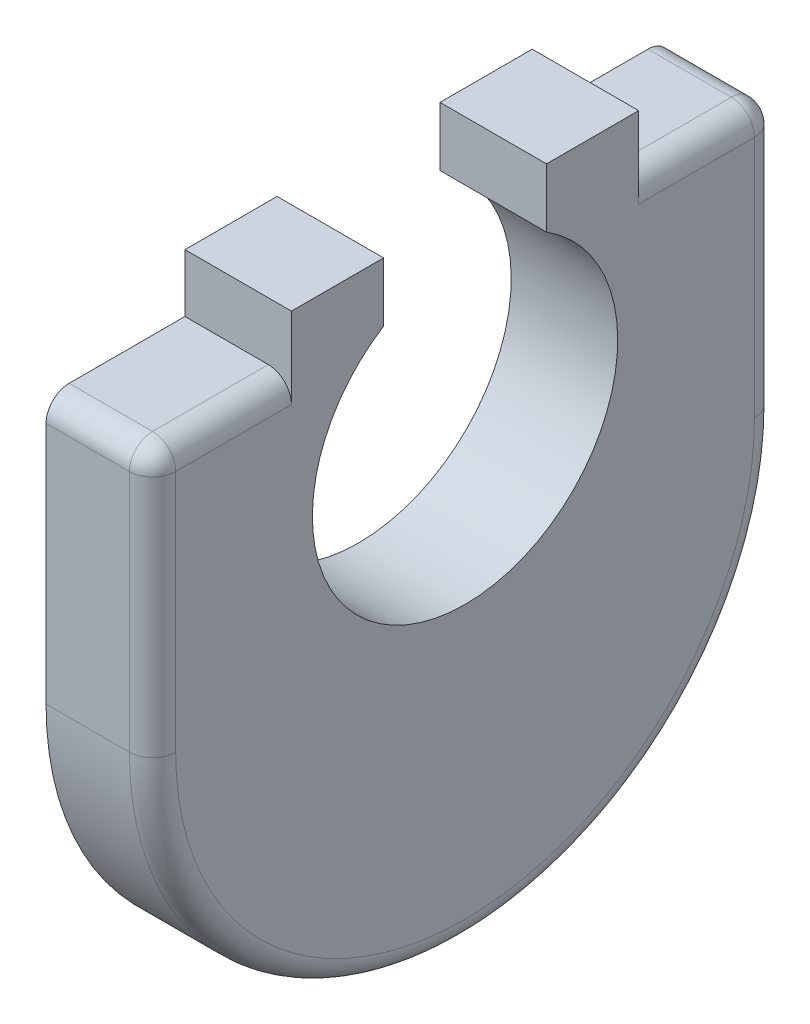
ISO-10303-21;
HEADER;
FILE_DESCRIPTION(('STEP AP214'),'2;1');
FILE_NAME('part.step','',(''),(''),'','','');
FILE_SCHEMA(('AUTOMOTIVE_DESIGN { 1 0 10303 214 1 1 1 1 }'));
ENDSEC;
DATA;
#1=APPLICATION_CONTEXT('core data for automotive mechanical design processes');
#2=APPLICATION_PROTOCOL_DEFINITION('international standard','automotive_design',2000,#1);
#3=PRODUCT_CONTEXT('',#1,'mechanical');
#4=PRODUCT('Part','Part','',(#3));
#5=PRODUCT_RELATED_PRODUCT_CATEGORY('part','',(#4));
#6=PRODUCT_DEFINITION_FORMATION('','',#4);
#7=PRODUCT_DEFINITION_CONTEXT('part definition',#1,'design');
#8=PRODUCT_DEFINITION('design','',#6,#7);
#9=PRODUCT_DEFINITION_SHAPE('','',#8);
#10=(LENGTH_UNIT() NAMED_UNIT(*) SI_UNIT(.MILLI.,.METRE.));
#11=(NAMED_UNIT(*) PLANE_ANGLE_UNIT() SI_UNIT($,.RADIAN.));
#12=(NAMED_UNIT(*) SI_UNIT($,.STERADIAN.) SOLID_ANGLE_UNIT());
#13=UNCERTAINTY_MEASURE_WITH_UNIT(LENGTH_MEASURE(1.E-05),#10,'distance_accuracy_value','');
#14=(GEOMETRIC_REPRESENTATION_CONTEXT(3) GLOBAL_UNCERTAINTY_ASSIGNED_CONTEXT((#13)) GLOBAL_UNIT_ASSIGNED_CONTEXT((#10,
#11,#12)) REPRESENTATION_CONTEXT('',''));
#15=CARTESIAN_POINT('',(0.,0.,0.));
#16=DIRECTION('',(0.,0.,1.));
#17=DIRECTION('',(1.,0.,0.));
#18=AXIS2_PLACEMENT_3D('',#15,#16,#17);
#19=CARTESIAN_POINT('',(2.921,17.78,9.525));
#20=DIRECTION('',(0.,-1.,0.));
#21=DIRECTION('',(0.,0.,-1.));
#22=AXIS2_PLACEMENT_3D('',#19,#20,#21);
#23=PLANE('',#22);
#24=DIRECTION('',(1.,0.,0.));
#25=VECTOR('',#24,1.);
#26=CARTESIAN_POINT('',(-2.921,17.78,-4.46848893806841));
#27=LINE('',#26,#25);
#28=CARTESIAN_POINT('',(-2.921,17.78,-4.46848893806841));
#29=VERTEX_POINT('',#28);
#30=CARTESIAN_POINT('',(2.921,17.78,-4.46848893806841));
#31=VERTEX_POINT('',#30);
#32=EDGE_CURVE('E264',#29,#31,#27,.T.);
#33=ORIENTED_EDGE('',*,*,#32,.T.);
#34=DIRECTION('',(0.,0.,1.));
#35=VECTOR('',#34,1.);
#36=CARTESIAN_POINT('',(2.921,17.78,9.525));
#37=LINE('',#36,#35);
#38=CARTESIAN_POINT('',(2.921,17.78,-9.525));
#39=VERTEX_POINT('',#38);
#40=EDGE_CURVE('E273',#39,#31,#37,.T.);
#41=ORIENTED_EDGE('',*,*,#40,.F.);
#42=DIRECTION('',(-1.,0.,0.));
#43=VECTOR('',#42,1.);
#44=CARTESIAN_POINT('',(2.921,17.78,-9.525));
#45=LINE('',#44,#43);
#46=CARTESIAN_POINT('',(-2.921,17.78,-9.525));
#47=VERTEX_POINT('',#46);
#48=EDGE_CURVE('E308',#39,#47,#45,.T.);
#49=ORIENTED_EDGE('',*,*,#48,.T.);
#50=DIRECTION('',(0.,0.,1.));
#51=VECTOR('',#50,1.);
#52=CARTESIAN_POINT('',(-2.921,17.78,9.525));
#53=LINE('',#52,#51);
#54=EDGE_CURVE('E291',#47,#29,#53,.T.);
#55=ORIENTED_EDGE('',*,*,#54,.T.);
#56=EDGE_LOOP('',(#33,#41,#49,#55));
#57=FACE_BOUND('',#56,.T.);
#58=ADVANCED_FACE('F32',(#57),#23,.F.);
#59=CARTESIAN_POINT('',(2.921,0.,0.));
#60=DIRECTION('',(-1.,0.,0.));
#61=DIRECTION('',(0.,0.,1.));
#62=AXIS2_PLACEMENT_3D('',#59,#60,#61);
#63=CYLINDRICAL_SURFACE('',#62,17.145);
#64=DIRECTION('',(-1.,0.,0.));
#65=VECTOR('',#64,1.);
#66=CARTESIAN_POINT('',(2.921,0.,-17.145));
#67=LINE('',#66,#65);
#68=CARTESIAN_POINT('',(1.651,0.,-17.145));
#69=VERTEX_POINT('',#68);
#70=CARTESIAN_POINT('',(-2.921,0.,-17.145));
#71=VERTEX_POINT('',#70);
#72=EDGE_CURVE('E313',#69,#71,#67,.T.);
#73=ORIENTED_EDGE('',*,*,#72,.F.);
#74=CARTESIAN_POINT('',(1.651,0.,0.));
#75=DIRECTION('',(1.,0.,0.));
#76=DIRECTION('',(0.,0.,-1.));
#77=AXIS2_PLACEMENT_3D('',#74,#75,#76);
#78=CIRCLE('',#77,17.145);
#79=CARTESIAN_POINT('',(1.651,0.,17.145));
#80=VERTEX_POINT('',#79);
#81=EDGE_CURVE('E331',#69,#80,#78,.F.);
#82=ORIENTED_EDGE('',*,*,#81,.T.);
#83=DIRECTION('',(-1.,0.,0.));
#84=VECTOR('',#83,1.);
#85=CARTESIAN_POINT('',(2.921,0.,17.145));
#86=LINE('',#85,#84);
#87=CARTESIAN_POINT('',(-2.921,0.,17.145));
#88=VERTEX_POINT('',#87);
#89=EDGE_CURVE('E278',#80,#88,#86,.T.);
#90=ORIENTED_EDGE('',*,*,#89,.T.);
#91=CARTESIAN_POINT('',(-2.921,0.,0.));
#92=DIRECTION('',(1.,0.,0.));
#93=DIRECTION('',(0.,0.,-1.));
#94=AXIS2_PLACEMENT_3D('',#91,#92,#93);
#95=CIRCLE('',#94,17.145);
#96=EDGE_CURVE('E279',#88,#71,#95,.T.);
#97=ORIENTED_EDGE('',*,*,#96,.T.);
#98=EDGE_LOOP('',(#73,#82,#90,#97));
#99=FACE_BOUND('',#98,.T.);
#100=ADVANCED_FACE('F412',(#99),#63,.T.);
#101=CARTESIAN_POINT('',(2.921,14.605,-17.145));
#102=DIRECTION('',(0.,0.,1.));
#103=DIRECTION('',(0.,-1.,0.));
#104=AXIS2_PLACEMENT_3D('',#101,#102,#103);
#105=PLANE('',#104);
#106=DIRECTION('',(-1.,0.,0.));
#107=VECTOR('',#106,1.);
#108=CARTESIAN_POINT('',(2.921,13.335,-17.145));
#109=LINE('',#108,#107);
#110=CARTESIAN_POINT('',(-2.921,13.335,-17.145));
#111=VERTEX_POINT('',#110);
#112=CARTESIAN_POINT('',(1.651,13.335,-17.145));
#113=VERTEX_POINT('',#112);
#114=EDGE_CURVE('E327',#111,#113,#109,.F.);
#115=ORIENTED_EDGE('',*,*,#114,.T.);
#116=DIRECTION('',(0.,1.,0.));
#117=VECTOR('',#116,1.);
#118=CARTESIAN_POINT('',(1.651,0.,-17.145));
#119=LINE('',#118,#117);
#120=EDGE_CURVE('E329',#113,#69,#119,.F.);
#121=ORIENTED_EDGE('',*,*,#120,.T.);
#122=ORIENTED_EDGE('',*,*,#72,.T.);
#123=DIRECTION('',(0.,1.,0.));
#124=VECTOR('',#123,1.);
#125=CARTESIAN_POINT('',(-2.921,14.605,-17.145));
#126=LINE('',#125,#124);
#127=EDGE_CURVE('E282',#71,#111,#126,.T.);
#128=ORIENTED_EDGE('',*,*,#127,.T.);
#129=EDGE_LOOP('',(#115,#121,#122,#128));
#130=FACE_BOUND('',#129,.T.);
#131=ADVANCED_FACE('F463',(#130),#105,.F.);
#132=CARTESIAN_POINT('',(2.921,14.605,-9.525));
#133=DIRECTION('',(0.,-1.,0.));
#134=DIRECTION('',(0.,0.,-1.));
#135=AXIS2_PLACEMENT_3D('',#132,#133,#134);
#136=PLANE('',#135);
#137=DIRECTION('',(-1.,0.,0.));
#138=VECTOR('',#137,1.);
#139=CARTESIAN_POINT('',(2.921,14.605,-9.525));
#140=LINE('',#139,#138);
#141=CARTESIAN_POINT('',(1.651,14.605,-9.525));
#142=VERTEX_POINT('',#141);
#143=CARTESIAN_POINT('',(-2.921,14.605,-9.525));
#144=VERTEX_POINT('',#143);
#145=EDGE_CURVE('E311',#142,#144,#140,.T.);
#146=ORIENTED_EDGE('',*,*,#145,.F.);
#147=DIRECTION('',(0.,0.,1.));
#148=VECTOR('',#147,1.);
#149=CARTESIAN_POINT('',(1.651,14.605,-17.145));
#150=LINE('',#149,#148);
#151=CARTESIAN_POINT('',(1.651,14.605,-15.875));
#152=VERTEX_POINT('',#151);
#153=EDGE_CURVE('E335',#142,#152,#150,.F.);
#154=ORIENTED_EDGE('',*,*,#153,.T.);
#155=DIRECTION('',(-1.,0.,0.));
#156=VECTOR('',#155,1.);
#157=CARTESIAN_POINT('',(2.921,14.605,-15.875));
#158=LINE('',#157,#156);
#159=CARTESIAN_POINT('',(-2.921,14.605,-15.875));
#160=VERTEX_POINT('',#159);
#161=EDGE_CURVE('E333',#152,#160,#158,.T.);
#162=ORIENTED_EDGE('',*,*,#161,.T.);
#163=DIRECTION('',(0.,0.,1.));
#164=VECTOR('',#163,1.);
#165=CARTESIAN_POINT('',(-2.921,14.605,-9.525));
#166=LINE('',#165,#164);
#167=EDGE_CURVE('E285',#160,#144,#166,.T.);
#168=ORIENTED_EDGE('',*,*,#167,.T.);
#169=EDGE_LOOP('',(#146,#154,#162,#168));
#170=FACE_BOUND('',#169,.T.);
#171=ADVANCED_FACE('F432',(#170),#136,.F.);
#172=CARTESIAN_POINT('',(2.921,14.605,-9.525));
#173=DIRECTION('',(0.,0.,1.));
#174=DIRECTION('',(1.,0.,0.));
#175=AXIS2_PLACEMENT_3D('',#172,#173,#174);
#176=PLANE('',#175);
#177=DIRECTION('',(0.,1.,0.));
#178=VECTOR('',#177,1.);
#179=CARTESIAN_POINT('',(-2.921,14.605,-9.525));
#180=LINE('',#179,#178);
#181=EDGE_CURVE('E288',#144,#47,#180,.T.);
#182=ORIENTED_EDGE('',*,*,#181,.T.);
#183=ORIENTED_EDGE('',*,*,#48,.F.);
#184=DIRECTION('',(0.,1.,0.));
#185=VECTOR('',#184,1.);
#186=CARTESIAN_POINT('',(2.921,14.605,-9.525));
#187=LINE('',#186,#185);
#188=CARTESIAN_POINT('',(2.921,13.335,-9.525));
#189=VERTEX_POINT('',#188);
#190=EDGE_CURVE('E269',#189,#39,#187,.T.);
#191=ORIENTED_EDGE('',*,*,#190,.F.);
#192=CARTESIAN_POINT('',(1.651,13.335,-9.525));
#193=DIRECTION('',(0.,0.,1.));
#194=DIRECTION('',(1.,0.,0.));
#195=AXIS2_PLACEMENT_3D('',#192,#193,#194);
#196=CIRCLE('',#195,1.27);
#197=EDGE_CURVE('E41',#189,#142,#196,.T.);
#198=ORIENTED_EDGE('',*,*,#197,.T.);
#199=ORIENTED_EDGE('',*,*,#145,.T.);
#200=EDGE_LOOP('',(#182,#183,#191,#198,#199));
#201=FACE_BOUND('',#200,.T.);
#202=ADVANCED_FACE('F430',(#201),#176,.F.);
#203=CARTESIAN_POINT('',(2.921,17.78,4.46848893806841));
#204=VERTEX_POINT('',#203);
#205=CARTESIAN_POINT('',(2.921,17.78,9.525));
#206=VERTEX_POINT('',#205);
#207=EDGE_CURVE('E271',#204,#206,#37,.T.);
#208=ORIENTED_EDGE('',*,*,#207,.F.);
#209=DIRECTION('',(1.,0.,0.));
#210=VECTOR('',#209,1.);
#211=CARTESIAN_POINT('',(-2.921,17.78,4.46848893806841));
#212=LINE('',#211,#210);
#213=CARTESIAN_POINT('',(-2.921,17.78,4.46848893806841));
#214=VERTEX_POINT('',#213);
#215=EDGE_CURVE('E261',#214,#204,#212,.T.);
#216=ORIENTED_EDGE('',*,*,#215,.F.);
#217=CARTESIAN_POINT('',(-2.921,17.78,9.525));
#218=VERTEX_POINT('',#217);
#219=EDGE_CURVE('E290',#214,#218,#53,.T.);
#220=ORIENTED_EDGE('',*,*,#219,.T.);
#221=DIRECTION('',(-1.,0.,0.));
#222=VECTOR('',#221,1.);
#223=CARTESIAN_POINT('',(2.921,17.78,9.525));
#224=LINE('',#223,#222);
#225=EDGE_CURVE('E305',#206,#218,#224,.T.);
#226=ORIENTED_EDGE('',*,*,#225,.F.);
#227=EDGE_LOOP('',(#208,#216,#220,#226));
#228=FACE_BOUND('',#227,.T.);
#229=ADVANCED_FACE('F450',(#228),#23,.F.);
#230=CARTESIAN_POINT('',(2.921,14.605,9.525));
#231=DIRECTION('',(0.,0.,-1.));
#232=DIRECTION('',(-1.,0.,0.));
#233=AXIS2_PLACEMENT_3D('',#230,#231,#232);
#234=PLANE('',#233);
#235=DIRECTION('',(0.,-1.,0.));
#236=VECTOR('',#235,1.);
#237=CARTESIAN_POINT('',(-2.921,14.605,9.525));
#238=LINE('',#237,#236);
#239=CARTESIAN_POINT('',(-2.921,14.605,9.525));
#240=VERTEX_POINT('',#239);
#241=EDGE_CURVE('E294',#218,#240,#238,.T.);
#242=ORIENTED_EDGE('',*,*,#241,.T.);
#243=DIRECTION('',(-1.,0.,0.));
#244=VECTOR('',#243,1.);
#245=CARTESIAN_POINT('',(2.921,14.605,9.525));
#246=LINE('',#245,#244);
#247=CARTESIAN_POINT('',(1.651,14.605,9.525));
#248=VERTEX_POINT('',#247);
#249=EDGE_CURVE('E303',#248,#240,#246,.T.);
#250=ORIENTED_EDGE('',*,*,#249,.F.);
#251=CARTESIAN_POINT('',(1.651,13.335,9.525));
#252=DIRECTION('',(0.,0.,-1.));
#253=DIRECTION('',(-1.,0.,0.));
#254=AXIS2_PLACEMENT_3D('',#251,#252,#253);
#255=CIRCLE('',#254,1.27);
#256=CARTESIAN_POINT('',(2.921,13.335,9.525));
#257=VERTEX_POINT('',#256);
#258=EDGE_CURVE('E11',#248,#257,#255,.T.);
#259=ORIENTED_EDGE('',*,*,#258,.T.);
#260=DIRECTION('',(0.,-1.,0.));
#261=VECTOR('',#260,1.);
#262=CARTESIAN_POINT('',(2.921,14.605,9.525));
#263=LINE('',#262,#261);
#264=EDGE_CURVE('E276',#206,#257,#263,.T.);
#265=ORIENTED_EDGE('',*,*,#264,.F.);
#266=ORIENTED_EDGE('',*,*,#225,.T.);
#267=EDGE_LOOP('',(#242,#250,#259,#265,#266));
#268=FACE_BOUND('',#267,.T.);
#269=ADVANCED_FACE('F396',(#268),#234,.F.);
#270=CARTESIAN_POINT('',(2.921,14.605,17.145));
#271=DIRECTION('',(0.,-1.,0.));
#272=DIRECTION('',(0.,0.,-1.));
#273=AXIS2_PLACEMENT_3D('',#270,#271,#272);
#274=PLANE('',#273);
#275=DIRECTION('',(-1.,0.,0.));
#276=VECTOR('',#275,1.);
#277=CARTESIAN_POINT('',(2.921,14.605,15.875));
#278=LINE('',#277,#276);
#279=CARTESIAN_POINT('',(-2.921,14.605,15.875));
#280=VERTEX_POINT('',#279);
#281=CARTESIAN_POINT('',(1.651,14.605,15.875));
#282=VERTEX_POINT('',#281);
#283=EDGE_CURVE('E337',#280,#282,#278,.F.);
#284=ORIENTED_EDGE('',*,*,#283,.T.);
#285=DIRECTION('',(0.,0.,1.));
#286=VECTOR('',#285,1.);
#287=CARTESIAN_POINT('',(1.651,14.605,9.525));
#288=LINE('',#287,#286);
#289=EDGE_CURVE('E339',#282,#248,#288,.F.);
#290=ORIENTED_EDGE('',*,*,#289,.T.);
#291=ORIENTED_EDGE('',*,*,#249,.T.);
#292=DIRECTION('',(0.,0.,1.));
#293=VECTOR('',#292,1.);
#294=CARTESIAN_POINT('',(-2.921,14.605,17.145));
#295=LINE('',#294,#293);
#296=EDGE_CURVE('E297',#240,#280,#295,.T.);
#297=ORIENTED_EDGE('',*,*,#296,.T.);
#298=EDGE_LOOP('',(#284,#290,#291,#297));
#299=FACE_BOUND('',#298,.T.);
#300=ADVANCED_FACE('F394',(#299),#274,.F.);
#301=CARTESIAN_POINT('',(2.921,0.,17.145));
#302=DIRECTION('',(0.,0.,-1.));
#303=DIRECTION('',(0.,1.,0.));
#304=AXIS2_PLACEMENT_3D('',#301,#302,#303);
#305=PLANE('',#304);
#306=DIRECTION('',(0.,-1.,0.));
#307=VECTOR('',#306,1.);
#308=CARTESIAN_POINT('',(1.651,14.605,17.145));
#309=LINE('',#308,#307);
#310=CARTESIAN_POINT('',(1.651,13.335,17.145));
#311=VERTEX_POINT('',#310);
#312=EDGE_CURVE('E345',#80,#311,#309,.F.);
#313=ORIENTED_EDGE('',*,*,#312,.T.);
#314=DIRECTION('',(-1.,0.,0.));
#315=VECTOR('',#314,1.);
#316=CARTESIAN_POINT('',(2.921,13.335,17.145));
#317=LINE('',#316,#315);
#318=CARTESIAN_POINT('',(-2.921,13.335,17.145));
#319=VERTEX_POINT('',#318);
#320=EDGE_CURVE('E347',#311,#319,#317,.T.);
#321=ORIENTED_EDGE('',*,*,#320,.T.);
#322=DIRECTION('',(0.,-1.,0.));
#323=VECTOR('',#322,1.);
#324=CARTESIAN_POINT('',(-2.921,0.,17.145));
#325=LINE('',#324,#323);
#326=EDGE_CURVE('E272',#319,#88,#325,.T.);
#327=ORIENTED_EDGE('',*,*,#326,.T.);
#328=ORIENTED_EDGE('',*,*,#89,.F.);
#329=EDGE_LOOP('',(#313,#321,#327,#328));
#330=FACE_BOUND('',#329,.T.);
#331=ADVANCED_FACE('F406',(#330),#305,.F.);
#332=CARTESIAN_POINT('',(2.921,0.,0.));
#333=DIRECTION('',(1.,0.,0.));
#334=DIRECTION('',(0.,0.,-1.));
#335=AXIS2_PLACEMENT_3D('',#332,#333,#334);
#336=PLANE('',#335);
#337=DIRECTION('',(0.,-1.,0.));
#338=VECTOR('',#337,1.);
#339=CARTESIAN_POINT('',(2.921,0.,4.46848893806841));
#340=LINE('',#339,#338);
#341=CARTESIAN_POINT('',(2.921,14.5386227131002,4.46848893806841));
#342=VERTEX_POINT('',#341);
#343=EDGE_CURVE('E237',#204,#342,#340,.T.);
#344=ORIENTED_EDGE('',*,*,#343,.F.);
#345=ORIENTED_EDGE('',*,*,#207,.T.);
#346=ORIENTED_EDGE('',*,*,#264,.T.);
#347=DIRECTION('',(0.,0.,1.));
#348=VECTOR('',#347,1.);
#349=CARTESIAN_POINT('',(2.921,13.335,17.145));
#350=LINE('',#349,#348);
#351=CARTESIAN_POINT('',(2.921,13.335,15.875));
#352=VERTEX_POINT('',#351);
#353=EDGE_CURVE('E317',#257,#352,#350,.T.);
#354=ORIENTED_EDGE('',*,*,#353,.T.);
#355=DIRECTION('',(0.,-1.,0.));
#356=VECTOR('',#355,1.);
#357=CARTESIAN_POINT('',(2.921,0.,15.875));
#358=LINE('',#357,#356);
#359=CARTESIAN_POINT('',(2.921,0.,15.875));
#360=VERTEX_POINT('',#359);
#361=EDGE_CURVE('E315',#352,#360,#358,.T.);
#362=ORIENTED_EDGE('',*,*,#361,.T.);
#363=CARTESIAN_POINT('',(2.921,0.,0.));
#364=DIRECTION('',(1.,0.,0.));
#365=DIRECTION('',(0.,0.,-1.));
#366=AXIS2_PLACEMENT_3D('',#363,#364,#365);
#367=CIRCLE('',#366,15.875);
#368=CARTESIAN_POINT('',(2.921,0.,-15.875));
#369=VERTEX_POINT('',#368);
#370=EDGE_CURVE('E319',#360,#369,#367,.T.);
#371=ORIENTED_EDGE('',*,*,#370,.T.);
#372=DIRECTION('',(0.,1.,0.));
#373=VECTOR('',#372,1.);
#374=CARTESIAN_POINT('',(2.921,14.605,-15.875));
#375=LINE('',#374,#373);
#376=CARTESIAN_POINT('',(2.921,13.335,-15.875));
#377=VERTEX_POINT('',#376);
#378=EDGE_CURVE('E321',#369,#377,#375,.T.);
#379=ORIENTED_EDGE('',*,*,#378,.T.);
#380=DIRECTION('',(0.,0.,1.));
#381=VECTOR('',#380,1.);
#382=CARTESIAN_POINT('',(2.921,13.335,-9.525));
#383=LINE('',#382,#381);
#384=EDGE_CURVE('E324',#377,#189,#383,.T.);
#385=ORIENTED_EDGE('',*,*,#384,.T.);
#386=ORIENTED_EDGE('',*,*,#190,.T.);
#387=ORIENTED_EDGE('',*,*,#40,.T.);
#388=DIRECTION('',(0.,-1.,0.));
#389=VECTOR('',#388,1.);
#390=CARTESIAN_POINT('',(2.921,0.,-4.46848893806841));
#391=LINE('',#390,#389);
#392=CARTESIAN_POINT('',(2.921,14.5386227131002,-4.46848893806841));
#393=VERTEX_POINT('',#392);
#394=EDGE_CURVE('E249',#31,#393,#391,.T.);
#395=ORIENTED_EDGE('',*,*,#394,.T.);
#396=CARTESIAN_POINT('',(2.921,7.45454764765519,0.));
#397=DIRECTION('',(1.,0.,0.));
#398=DIRECTION('',(0.,0.,-1.));
#399=AXIS2_PLACEMENT_3D('',#396,#397,#398);
#400=CIRCLE('',#399,8.37564999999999);
#401=EDGE_CURVE('E257',#342,#393,#400,.T.);
#402=ORIENTED_EDGE('',*,*,#401,.F.);
#403=EDGE_LOOP('',(#344,#345,#346,#354,#362,#371,#379,#385,#386,#387,#395,#402));
#404=FACE_BOUND('',#403,.T.);
#405=ADVANCED_FACE('F384',(#404),#336,.T.);
#406=CARTESIAN_POINT('',(-2.921,0.,0.));
#407=DIRECTION('',(1.,0.,0.));
#408=DIRECTION('',(0.,0.,-1.));
#409=AXIS2_PLACEMENT_3D('',#406,#407,#408);
#410=PLANE('',#409);
#411=DIRECTION('',(0.,0.,-1.));
#412=VECTOR('',#411,1.);
#413=CARTESIAN_POINT('',(-2.921,11.811,-10.2850573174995));
#414=LINE('',#413,#412);
#415=CARTESIAN_POINT('',(-2.921,11.811,-10.2850573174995));
#416=VERTEX_POINT('',#415);
#417=CARTESIAN_POINT('',(-2.921,11.811,-14.351));
#418=VERTEX_POINT('',#417);
#419=EDGE_CURVE('E225',#416,#418,#414,.T.);
#420=ORIENTED_EDGE('',*,*,#419,.F.);
#421=CARTESIAN_POINT('',(-2.921,7.45454764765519,0.));
#422=DIRECTION('',(1.,0.,0.));
#423=DIRECTION('',(0.,0.,1.));
#424=AXIS2_PLACEMENT_3D('',#421,#422,#423);
#425=CIRCLE('',#424,11.16965);
#426=CARTESIAN_POINT('',(-2.921,11.811,10.2850573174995));
#427=VERTEX_POINT('',#426);
#428=EDGE_CURVE('E49',#427,#416,#425,.T.);
#429=ORIENTED_EDGE('',*,*,#428,.F.);
#430=DIRECTION('',(0.,0.,-1.));
#431=VECTOR('',#430,1.);
#432=CARTESIAN_POINT('',(-2.921,11.811,14.351));
#433=LINE('',#432,#431);
#434=CARTESIAN_POINT('',(-2.921,11.811,14.351));
#435=VERTEX_POINT('',#434);
#436=EDGE_CURVE('E211',#435,#427,#433,.T.);
#437=ORIENTED_EDGE('',*,*,#436,.F.);
#438=DIRECTION('',(0.,1.,0.));
#439=VECTOR('',#438,1.);
#440=CARTESIAN_POINT('',(-2.921,0.,14.351));
#441=LINE('',#440,#439);
#442=CARTESIAN_POINT('',(-2.921,0.,14.351));
#443=VERTEX_POINT('',#442);
#444=EDGE_CURVE('E214',#443,#435,#441,.T.);
#445=ORIENTED_EDGE('',*,*,#444,.F.);
#446=CARTESIAN_POINT('',(-2.921,0.,0.));
#447=DIRECTION('',(-1.,0.,0.));
#448=DIRECTION('',(0.,0.,1.));
#449=AXIS2_PLACEMENT_3D('',#446,#447,#448);
#450=CIRCLE('',#449,14.351);
#451=CARTESIAN_POINT('',(-2.921,0.,-14.351));
#452=VERTEX_POINT('',#451);
#453=EDGE_CURVE('E230',#452,#443,#450,.T.);
#454=ORIENTED_EDGE('',*,*,#453,.F.);
#455=DIRECTION('',(0.,-1.,0.));
#456=VECTOR('',#455,1.);
#457=CARTESIAN_POINT('',(-2.921,11.811,-14.351));
#458=LINE('',#457,#456);
#459=EDGE_CURVE('E227',#418,#452,#458,.T.);
#460=ORIENTED_EDGE('',*,*,#459,.F.);
#461=EDGE_LOOP('',(#420,#429,#437,#445,#454,#460));
#462=FACE_BOUND('',#461,.T.);
#463=ORIENTED_EDGE('',*,*,#219,.F.);
#464=DIRECTION('',(0.,-1.,0.));
#465=VECTOR('',#464,1.);
#466=CARTESIAN_POINT('',(-2.921,0.,4.46848893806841));
#467=LINE('',#466,#465);
#468=CARTESIAN_POINT('',(-2.921,14.5386227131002,4.46848893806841));
#469=VERTEX_POINT('',#468);
#470=EDGE_CURVE('E245',#214,#469,#467,.T.);
#471=ORIENTED_EDGE('',*,*,#470,.T.);
#472=CARTESIAN_POINT('',(-2.921,7.45454764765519,0.));
#473=DIRECTION('',(1.,0.,0.));
#474=DIRECTION('',(0.,0.,-1.));
#475=AXIS2_PLACEMENT_3D('',#472,#473,#474);
#476=CIRCLE('',#475,8.37564999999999);
#477=CARTESIAN_POINT('',(-2.921,14.5386227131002,-4.46848893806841));
#478=VERTEX_POINT('',#477);
#479=EDGE_CURVE('E248',#469,#478,#476,.T.);
#480=ORIENTED_EDGE('',*,*,#479,.T.);
#481=DIRECTION('',(0.,-1.,0.));
#482=VECTOR('',#481,1.);
#483=CARTESIAN_POINT('',(-2.921,0.,-4.46848893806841));
#484=LINE('',#483,#482);
#485=EDGE_CURVE('E252',#29,#478,#484,.T.);
#486=ORIENTED_EDGE('',*,*,#485,.F.);
#487=ORIENTED_EDGE('',*,*,#54,.F.);
#488=ORIENTED_EDGE('',*,*,#181,.F.);
#489=ORIENTED_EDGE('',*,*,#167,.F.);
#490=CARTESIAN_POINT('',(-2.921,13.335,-15.875));
#491=DIRECTION('',(1.,0.,0.));
#492=DIRECTION('',(0.,0.,-1.));
#493=AXIS2_PLACEMENT_3D('',#490,#491,#492);
#494=CIRCLE('',#493,1.27);
#495=EDGE_CURVE('E343',#160,#111,#494,.F.);
#496=ORIENTED_EDGE('',*,*,#495,.T.);
#497=ORIENTED_EDGE('',*,*,#127,.F.);
#498=ORIENTED_EDGE('',*,*,#96,.F.);
#499=ORIENTED_EDGE('',*,*,#326,.F.);
#500=CARTESIAN_POINT('',(-2.921,13.335,15.875));
#501=DIRECTION('',(1.,0.,0.));
#502=DIRECTION('',(0.,0.,-1.));
#503=AXIS2_PLACEMENT_3D('',#500,#501,#502);
#504=CIRCLE('',#503,1.27);
#505=EDGE_CURVE('E341',#319,#280,#504,.F.);
#506=ORIENTED_EDGE('',*,*,#505,.T.);
#507=ORIENTED_EDGE('',*,*,#296,.F.);
#508=ORIENTED_EDGE('',*,*,#241,.F.);
#509=EDGE_LOOP('',(#463,#471,#480,#486,#487,#488,#489,#496,#497,#498,#499,#506,#507,#508));
#510=FACE_BOUND('',#509,.T.);
#511=ADVANCED_FACE('F402',(#462,#510),#410,.F.);
#512=CARTESIAN_POINT('',(2.921,13.335,15.875));
#513=DIRECTION('',(-1.,0.,0.));
#514=DIRECTION('',(0.,0.,1.));
#515=AXIS2_PLACEMENT_3D('',#512,#513,#514);
#516=CYLINDRICAL_SURFACE('',#515,1.27);
#517=ORIENTED_EDGE('',*,*,#505,.F.);
#518=ORIENTED_EDGE('',*,*,#320,.F.);
#519=CARTESIAN_POINT('',(1.651,13.335,15.875));
#520=DIRECTION('',(1.,0.,0.));
#521=DIRECTION('',(0.,0.,-1.));
#522=AXIS2_PLACEMENT_3D('',#519,#520,#521);
#523=CIRCLE('',#522,1.27);
#524=EDGE_CURVE('E36',#282,#311,#523,.T.);
#525=ORIENTED_EDGE('',*,*,#524,.F.);
#526=ORIENTED_EDGE('',*,*,#283,.F.);
#527=EDGE_LOOP('',(#517,#518,#525,#526));
#528=FACE_BOUND('',#527,.T.);
#529=ADVANCED_FACE('F34',(#528),#516,.T.);
#530=CARTESIAN_POINT('',(1.651,13.335,0.));
#531=DIRECTION('',(0.,0.,-1.));
#532=DIRECTION('',(-1.,0.,0.));
#533=AXIS2_PLACEMENT_3D('',#530,#531,#532);
#534=CYLINDRICAL_SURFACE('',#533,1.27);
#535=ORIENTED_EDGE('',*,*,#258,.F.);
#536=ORIENTED_EDGE('',*,*,#289,.F.);
#537=CARTESIAN_POINT('',(1.651,13.335,15.875));
#538=DIRECTION('',(0.,0.,1.));
#539=DIRECTION('',(1.,0.,0.));
#540=AXIS2_PLACEMENT_3D('',#537,#538,#539);
#541=CIRCLE('',#540,1.27);
#542=EDGE_CURVE('E365',#352,#282,#541,.T.);
#543=ORIENTED_EDGE('',*,*,#542,.F.);
#544=ORIENTED_EDGE('',*,*,#353,.F.);
#545=EDGE_LOOP('',(#535,#536,#543,#544));
#546=FACE_BOUND('',#545,.T.);
#547=ADVANCED_FACE('F391',(#546),#534,.T.);
#548=CARTESIAN_POINT('',(1.651,13.335,15.875));
#549=DIRECTION('',(0.,0.,1.));
#550=DIRECTION('',(1.,0.,0.));
#551=AXIS2_PLACEMENT_3D('',#548,#549,#550);
#552=SPHERICAL_SURFACE('',#551,1.27);
#553=ORIENTED_EDGE('',*,*,#542,.T.);
#554=ORIENTED_EDGE('',*,*,#524,.T.);
#555=CARTESIAN_POINT('',(1.651,13.335,15.875));
#556=DIRECTION('',(0.,1.,0.));
#557=DIRECTION('',(0.,0.,1.));
#558=AXIS2_PLACEMENT_3D('',#555,#556,#557);
#559=CIRCLE('',#558,1.27);
#560=EDGE_CURVE('E363',#352,#311,#559,.F.);
#561=ORIENTED_EDGE('',*,*,#560,.F.);
#562=EDGE_LOOP('',(#553,#554,#561));
#563=FACE_BOUND('',#562,.T.);
#564=ADVANCED_FACE('F372',(#563),#552,.T.);
#565=CARTESIAN_POINT('',(1.651,0.,15.875));
#566=DIRECTION('',(0.,1.,0.));
#567=DIRECTION('',(0.,0.,1.));
#568=AXIS2_PLACEMENT_3D('',#565,#566,#567);
#569=CYLINDRICAL_SURFACE('',#568,1.27);
#570=ORIENTED_EDGE('',*,*,#560,.T.);
#571=ORIENTED_EDGE('',*,*,#312,.F.);
#572=CARTESIAN_POINT('',(1.651,0.,15.875));
#573=DIRECTION('',(0.,-1.,0.));
#574=DIRECTION('',(0.,0.,-1.));
#575=AXIS2_PLACEMENT_3D('',#572,#573,#574);
#576=CIRCLE('',#575,1.27);
#577=EDGE_CURVE('E360',#360,#80,#576,.T.);
#578=ORIENTED_EDGE('',*,*,#577,.F.);
#579=ORIENTED_EDGE('',*,*,#361,.F.);
#580=EDGE_LOOP('',(#570,#571,#578,#579));
#581=FACE_BOUND('',#580,.T.);
#582=ADVANCED_FACE('F379',(#581),#569,.T.);
#583=CARTESIAN_POINT('',(1.651,13.335,0.));
#584=DIRECTION('',(0.,0.,-1.));
#585=DIRECTION('',(-1.,0.,0.));
#586=AXIS2_PLACEMENT_3D('',#583,#584,#585);
#587=CYLINDRICAL_SURFACE('',#586,1.27);
#588=ORIENTED_EDGE('',*,*,#197,.F.);
#589=ORIENTED_EDGE('',*,*,#384,.F.);
#590=CARTESIAN_POINT('',(1.651,13.335,-15.875));
#591=DIRECTION('',(0.,0.,-1.));
#592=DIRECTION('',(-1.,0.,0.));
#593=AXIS2_PLACEMENT_3D('',#590,#591,#592);
#594=CIRCLE('',#593,1.27);
#595=EDGE_CURVE('E357',#152,#377,#594,.T.);
#596=ORIENTED_EDGE('',*,*,#595,.F.);
#597=ORIENTED_EDGE('',*,*,#153,.F.);
#598=EDGE_LOOP('',(#588,#589,#596,#597));
#599=FACE_BOUND('',#598,.T.);
#600=ADVANCED_FACE('F427',(#599),#587,.T.);
#601=CARTESIAN_POINT('',(2.921,13.335,-15.875));
#602=DIRECTION('',(-1.,0.,0.));
#603=DIRECTION('',(0.,0.,1.));
#604=AXIS2_PLACEMENT_3D('',#601,#602,#603);
#605=CYLINDRICAL_SURFACE('',#604,1.27);
#606=ORIENTED_EDGE('',*,*,#495,.F.);
#607=ORIENTED_EDGE('',*,*,#161,.F.);
#608=CARTESIAN_POINT('',(1.651,13.335,-15.875));
#609=DIRECTION('',(1.,0.,0.));
#610=DIRECTION('',(0.,0.,-1.));
#611=AXIS2_PLACEMENT_3D('',#608,#609,#610);
#612=CIRCLE('',#611,1.27);
#613=EDGE_CURVE('E354',#113,#152,#612,.T.);
#614=ORIENTED_EDGE('',*,*,#613,.F.);
#615=ORIENTED_EDGE('',*,*,#114,.F.);
#616=EDGE_LOOP('',(#606,#607,#614,#615));
#617=FACE_BOUND('',#616,.T.);
#618=ADVANCED_FACE('F480',(#617),#605,.T.);
#619=CARTESIAN_POINT('',(1.651,0.,0.));
#620=DIRECTION('',(1.,0.,0.));
#621=DIRECTION('',(0.,0.,-1.));
#622=AXIS2_PLACEMENT_3D('',#619,#620,#621);
#623=TOROIDAL_SURFACE('',#622,15.875,1.27);
#624=ORIENTED_EDGE('',*,*,#577,.T.);
#625=ORIENTED_EDGE('',*,*,#81,.F.);
#626=CARTESIAN_POINT('',(1.651,0.,-15.875));
#627=DIRECTION('',(0.,1.,0.));
#628=DIRECTION('',(0.,0.,1.));
#629=AXIS2_PLACEMENT_3D('',#626,#627,#628);
#630=CIRCLE('',#629,1.27);
#631=EDGE_CURVE('E351',#369,#69,#630,.T.);
#632=ORIENTED_EDGE('',*,*,#631,.F.);
#633=ORIENTED_EDGE('',*,*,#370,.F.);
#634=EDGE_LOOP('',(#624,#625,#632,#633));
#635=FACE_BOUND('',#634,.T.);
#636=ADVANCED_FACE('F415',(#635),#623,.T.);
#637=CARTESIAN_POINT('',(1.651,13.335,-15.875));
#638=DIRECTION('',(0.,0.,1.));
#639=DIRECTION('',(1.,0.,0.));
#640=AXIS2_PLACEMENT_3D('',#637,#638,#639);
#641=SPHERICAL_SURFACE('',#640,1.27);
#642=ORIENTED_EDGE('',*,*,#613,.T.);
#643=ORIENTED_EDGE('',*,*,#595,.T.);
#644=CARTESIAN_POINT('',(1.651,13.335,-15.875));
#645=DIRECTION('',(0.,1.,0.));
#646=DIRECTION('',(0.,0.,1.));
#647=AXIS2_PLACEMENT_3D('',#644,#645,#646);
#648=CIRCLE('',#647,1.27);
#649=EDGE_CURVE('E263',#113,#377,#648,.F.);
#650=ORIENTED_EDGE('',*,*,#649,.F.);
#651=EDGE_LOOP('',(#642,#643,#650));
#652=FACE_BOUND('',#651,.T.);
#653=ADVANCED_FACE('F474',(#652),#641,.T.);
#654=CARTESIAN_POINT('',(1.651,0.,-15.875));
#655=DIRECTION('',(0.,-1.,0.));
#656=DIRECTION('',(0.,0.,-1.));
#657=AXIS2_PLACEMENT_3D('',#654,#655,#656);
#658=CYLINDRICAL_SURFACE('',#657,1.27);
#659=ORIENTED_EDGE('',*,*,#631,.T.);
#660=ORIENTED_EDGE('',*,*,#120,.F.);
#661=ORIENTED_EDGE('',*,*,#649,.T.);
#662=ORIENTED_EDGE('',*,*,#378,.F.);
#663=EDGE_LOOP('',(#659,#660,#661,#662));
#664=FACE_BOUND('',#663,.T.);
#665=ADVANCED_FACE('F419',(#664),#658,.T.);
#666=CARTESIAN_POINT('',(-2.921,0.,4.46848893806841));
#667=DIRECTION('',(0.,0.,1.));
#668=DIRECTION('',(1.,0.,0.));
#669=AXIS2_PLACEMENT_3D('',#666,#667,#668);
#670=PLANE('',#669);
#671=ORIENTED_EDGE('',*,*,#343,.T.);
#672=DIRECTION('',(1.,0.,0.));
#673=VECTOR('',#672,1.);
#674=CARTESIAN_POINT('',(-2.921,14.5386227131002,4.46848893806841));
#675=LINE('',#674,#673);
#676=EDGE_CURVE('E254',#469,#342,#675,.T.);
#677=ORIENTED_EDGE('',*,*,#676,.F.);
#678=ORIENTED_EDGE('',*,*,#470,.F.);
#679=ORIENTED_EDGE('',*,*,#215,.T.);
#680=EDGE_LOOP('',(#671,#677,#678,#679));
#681=FACE_BOUND('',#680,.T.);
#682=ADVANCED_FACE('F446',(#681),#670,.F.);
#683=CARTESIAN_POINT('',(-2.921,0.,-4.46848893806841));
#684=DIRECTION('',(0.,0.,1.));
#685=DIRECTION('',(1.,0.,0.));
#686=AXIS2_PLACEMENT_3D('',#683,#684,#685);
#687=PLANE('',#686);
#688=ORIENTED_EDGE('',*,*,#394,.F.);
#689=ORIENTED_EDGE('',*,*,#32,.F.);
#690=ORIENTED_EDGE('',*,*,#485,.T.);
#691=DIRECTION('',(1.,0.,0.));
#692=VECTOR('',#691,1.);
#693=CARTESIAN_POINT('',(-2.921,14.5386227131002,-4.46848893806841));
#694=LINE('',#693,#692);
#695=EDGE_CURVE('E57',#478,#393,#694,.T.);
#696=ORIENTED_EDGE('',*,*,#695,.T.);
#697=EDGE_LOOP('',(#688,#689,#690,#696));
#698=FACE_BOUND('',#697,.T.);
#699=ADVANCED_FACE('F443',(#698),#687,.T.);
#700=CARTESIAN_POINT('',(-2.921,7.45454764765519,0.));
#701=DIRECTION('',(1.,0.,0.));
#702=DIRECTION('',(0.,0.,-1.));
#703=AXIS2_PLACEMENT_3D('',#700,#701,#702);
#704=CYLINDRICAL_SURFACE('',#703,8.37564999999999);
#705=ORIENTED_EDGE('',*,*,#401,.T.);
#706=ORIENTED_EDGE('',*,*,#695,.F.);
#707=ORIENTED_EDGE('',*,*,#479,.F.);
#708=ORIENTED_EDGE('',*,*,#676,.T.);
#709=EDGE_LOOP('',(#705,#706,#707,#708));
#710=FACE_BOUND('',#709,.T.);
#711=ADVANCED_FACE('F444',(#710),#704,.F.);
#712=CARTESIAN_POINT('',(-0.127,7.45454764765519,0.));
#713=DIRECTION('',(-1.,0.,0.));
#714=DIRECTION('',(0.,0.,1.));
#715=AXIS2_PLACEMENT_3D('',#712,#713,#714);
#716=CYLINDRICAL_SURFACE('',#715,11.16965);
#717=ORIENTED_EDGE('',*,*,#428,.T.);
#718=DIRECTION('',(-1.,0.,0.));
#719=VECTOR('',#718,1.);
#720=CARTESIAN_POINT('',(-0.127,11.811,-10.2850573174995));
#721=LINE('',#720,#719);
#722=CARTESIAN_POINT('',(-0.127,11.811,-10.2850573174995));
#723=VERTEX_POINT('',#722);
#724=EDGE_CURVE('E188',#723,#416,#721,.T.);
#725=ORIENTED_EDGE('',*,*,#724,.F.);
#726=CARTESIAN_POINT('',(-0.127,7.45454764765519,0.));
#727=DIRECTION('',(1.,0.,0.));
#728=DIRECTION('',(0.,0.,1.));
#729=AXIS2_PLACEMENT_3D('',#726,#727,#728);
#730=CIRCLE('',#729,11.16965);
#731=CARTESIAN_POINT('',(-0.127,11.811,10.2850573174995));
#732=VERTEX_POINT('',#731);
#733=EDGE_CURVE('E192',#732,#723,#730,.T.);
#734=ORIENTED_EDGE('',*,*,#733,.F.);
#735=DIRECTION('',(-1.,0.,0.));
#736=VECTOR('',#735,1.);
#737=CARTESIAN_POINT('',(-0.127,11.811,10.2850573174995));
#738=LINE('',#737,#736);
#739=EDGE_CURVE('E235',#732,#427,#738,.T.);
#740=ORIENTED_EDGE('',*,*,#739,.T.);
#741=EDGE_LOOP('',(#717,#725,#734,#740));
#742=FACE_BOUND('',#741,.T.);
#743=ADVANCED_FACE('F190',(#742),#716,.T.);
#744=CARTESIAN_POINT('',(-0.127,11.811,14.351));
#745=DIRECTION('',(0.,1.,0.));
#746=DIRECTION('',(0.,0.,1.));
#747=AXIS2_PLACEMENT_3D('',#744,#745,#746);
#748=PLANE('',#747);
#749=ORIENTED_EDGE('',*,*,#436,.T.);
#750=ORIENTED_EDGE('',*,*,#739,.F.);
#751=DIRECTION('',(0.,0.,-1.));
#752=VECTOR('',#751,1.);
#753=CARTESIAN_POINT('',(-0.127,11.811,14.351));
#754=LINE('',#753,#752);
#755=CARTESIAN_POINT('',(-0.127,11.811,14.351));
#756=VERTEX_POINT('',#755);
#757=EDGE_CURVE('E198',#756,#732,#754,.T.);
#758=ORIENTED_EDGE('',*,*,#757,.F.);
#759=DIRECTION('',(-1.,0.,0.));
#760=VECTOR('',#759,1.);
#761=CARTESIAN_POINT('',(-0.127,11.811,14.351));
#762=LINE('',#761,#760);
#763=EDGE_CURVE('E238',#756,#435,#762,.T.);
#764=ORIENTED_EDGE('',*,*,#763,.T.);
#765=EDGE_LOOP('',(#749,#750,#758,#764));
#766=FACE_BOUND('',#765,.T.);
#767=ADVANCED_FACE('F559',(#766),#748,.F.);
#768=CARTESIAN_POINT('',(-0.127,0.,14.351));
#769=DIRECTION('',(0.,0.,1.));
#770=DIRECTION('',(1.,0.,0.));
#771=AXIS2_PLACEMENT_3D('',#768,#769,#770);
#772=PLANE('',#771);
#773=ORIENTED_EDGE('',*,*,#444,.T.);
#774=ORIENTED_EDGE('',*,*,#763,.F.);
#775=DIRECTION('',(0.,1.,0.));
#776=VECTOR('',#775,1.);
#777=CARTESIAN_POINT('',(-0.127,0.,14.351));
#778=LINE('',#777,#776);
#779=CARTESIAN_POINT('',(-0.127,0.,14.351));
#780=VERTEX_POINT('',#779);
#781=EDGE_CURVE('E221',#780,#756,#778,.T.);
#782=ORIENTED_EDGE('',*,*,#781,.F.);
#783=DIRECTION('',(-1.,0.,0.));
#784=VECTOR('',#783,1.);
#785=CARTESIAN_POINT('',(-0.127,0.,14.351));
#786=LINE('',#785,#784);
#787=EDGE_CURVE('E240',#780,#443,#786,.T.);
#788=ORIENTED_EDGE('',*,*,#787,.T.);
#789=EDGE_LOOP('',(#773,#774,#782,#788));
#790=FACE_BOUND('',#789,.T.);
#791=ADVANCED_FACE('F568',(#790),#772,.F.);
#792=CARTESIAN_POINT('',(-0.127,0.,0.));
#793=DIRECTION('',(-1.,0.,0.));
#794=DIRECTION('',(0.,0.,1.));
#795=AXIS2_PLACEMENT_3D('',#792,#793,#794);
#796=CYLINDRICAL_SURFACE('',#795,14.351);
#797=ORIENTED_EDGE('',*,*,#453,.T.);
#798=ORIENTED_EDGE('',*,*,#787,.F.);
#799=CARTESIAN_POINT('',(-0.127,0.,0.));
#800=DIRECTION('',(-1.,0.,0.));
#801=DIRECTION('',(0.,0.,1.));
#802=AXIS2_PLACEMENT_3D('',#799,#800,#801);
#803=CIRCLE('',#802,14.351);
#804=CARTESIAN_POINT('',(-0.127,0.,-14.351));
#805=VERTEX_POINT('',#804);
#806=EDGE_CURVE('E218',#805,#780,#803,.T.);
#807=ORIENTED_EDGE('',*,*,#806,.F.);
#808=DIRECTION('',(-1.,0.,0.));
#809=VECTOR('',#808,1.);
#810=CARTESIAN_POINT('',(-0.127,0.,-14.351));
#811=LINE('',#810,#809);
#812=EDGE_CURVE('E242',#805,#452,#811,.T.);
#813=ORIENTED_EDGE('',*,*,#812,.T.);
#814=EDGE_LOOP('',(#797,#798,#807,#813));
#815=FACE_BOUND('',#814,.T.);
#816=ADVANCED_FACE('F578',(#815),#796,.F.);
#817=CARTESIAN_POINT('',(-0.127,11.811,-14.351));
#818=DIRECTION('',(0.,0.,-1.));
#819=DIRECTION('',(-1.,0.,0.));
#820=AXIS2_PLACEMENT_3D('',#817,#818,#819);
#821=PLANE('',#820);
#822=ORIENTED_EDGE('',*,*,#459,.T.);
#823=ORIENTED_EDGE('',*,*,#812,.F.);
#824=DIRECTION('',(0.,-1.,0.));
#825=VECTOR('',#824,1.);
#826=CARTESIAN_POINT('',(-0.127,11.811,-14.351));
#827=LINE('',#826,#825);
#828=CARTESIAN_POINT('',(-0.127,11.811,-14.351));
#829=VERTEX_POINT('',#828);
#830=EDGE_CURVE('E206',#829,#805,#827,.T.);
#831=ORIENTED_EDGE('',*,*,#830,.F.);
#832=DIRECTION('',(-1.,0.,0.));
#833=VECTOR('',#832,1.);
#834=CARTESIAN_POINT('',(-0.127,11.811,-14.351));
#835=LINE('',#834,#833);
#836=EDGE_CURVE('E197',#829,#418,#835,.T.);
#837=ORIENTED_EDGE('',*,*,#836,.T.);
#838=EDGE_LOOP('',(#822,#823,#831,#837));
#839=FACE_BOUND('',#838,.T.);
#840=ADVANCED_FACE('F588',(#839),#821,.F.);
#841=CARTESIAN_POINT('',(-0.127,11.811,-10.2850573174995));
#842=DIRECTION('',(0.,1.,0.));
#843=DIRECTION('',(0.,0.,1.));
#844=AXIS2_PLACEMENT_3D('',#841,#842,#843);
#845=PLANE('',#844);
#846=ORIENTED_EDGE('',*,*,#419,.T.);
#847=ORIENTED_EDGE('',*,*,#836,.F.);
#848=DIRECTION('',(0.,0.,-1.));
#849=VECTOR('',#848,1.);
#850=CARTESIAN_POINT('',(-0.127,11.811,-10.2850573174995));
#851=LINE('',#850,#849);
#852=EDGE_CURVE('E201',#723,#829,#851,.T.);
#853=ORIENTED_EDGE('',*,*,#852,.F.);
#854=ORIENTED_EDGE('',*,*,#724,.T.);
#855=EDGE_LOOP('',(#846,#847,#853,#854));
#856=FACE_BOUND('',#855,.T.);
#857=ADVANCED_FACE('F202',(#856),#845,.F.);
#858=CARTESIAN_POINT('',(-0.127,7.45454764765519,0.));
#859=DIRECTION('',(-1.,0.,0.));
#860=DIRECTION('',(0.,0.,1.));
#861=AXIS2_PLACEMENT_3D('',#858,#859,#860);
#862=PLANE('',#861);
#863=ORIENTED_EDGE('',*,*,#733,.T.);
#864=ORIENTED_EDGE('',*,*,#852,.T.);
#865=ORIENTED_EDGE('',*,*,#830,.T.);
#866=ORIENTED_EDGE('',*,*,#806,.T.);
#867=ORIENTED_EDGE('',*,*,#781,.T.);
#868=ORIENTED_EDGE('',*,*,#757,.T.);
#869=EDGE_LOOP('',(#863,#864,#865,#866,#867,#868));
#870=FACE_BOUND('',#869,.T.);
#871=ADVANCED_FACE('F208',(#870),#862,.T.);
#872=CLOSED_SHELL('',(#58,#100,#131,#171,#202,#229,#269,#300,#331,#405,#511,#529,#547,#564,#582,
#600,#618,#636,#653,#665,#682,#699,#711,#743,#767,#791,#816,#840,#857,#871));
#873=MANIFOLD_SOLID_BREP('B2',#872);
#874=ADVANCED_BREP_SHAPE_REPRESENTATION('',(#18,#873),#14);
#875=SHAPE_DEFINITION_REPRESENTATION(#9,#874);
ENDSEC;
END-ISO-10303-21;
